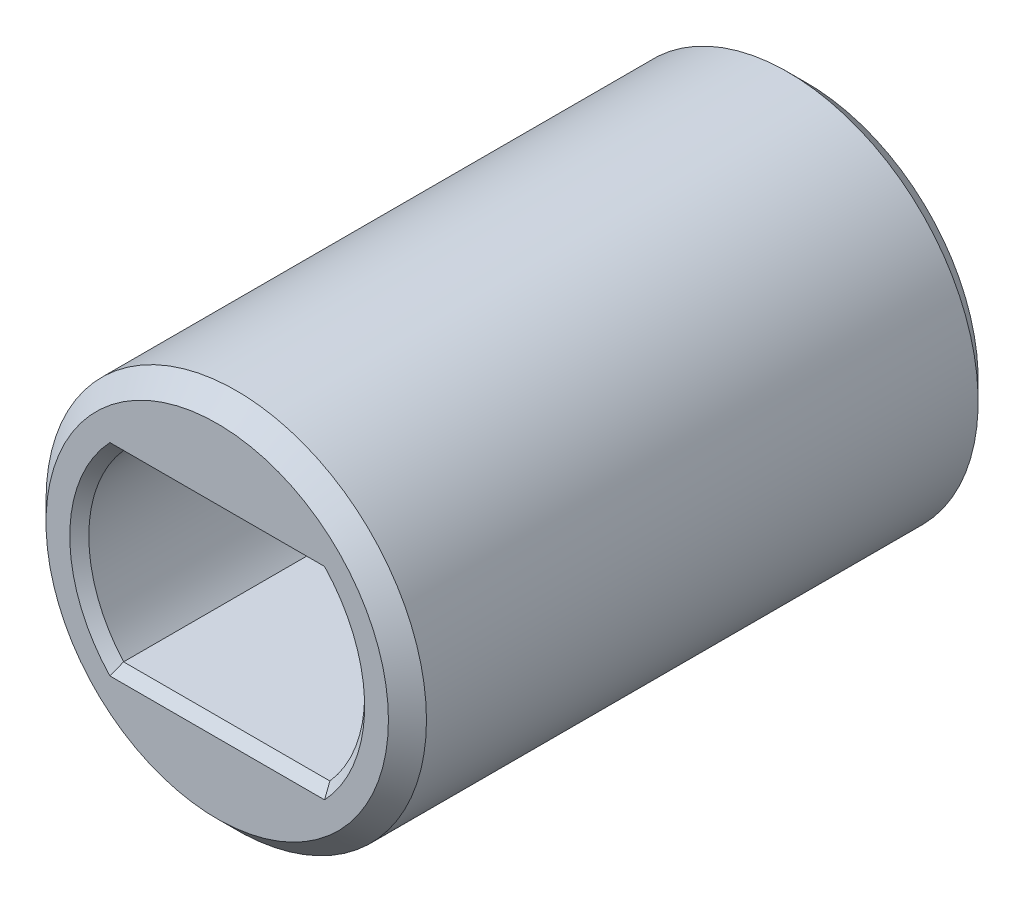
ISO-10303-21;
HEADER;
FILE_DESCRIPTION(('STEP AP214'),'2;1');
FILE_NAME('part.step','',(''),(''),'','','');
FILE_SCHEMA(('AUTOMOTIVE_DESIGN { 1 0 10303 214 1 1 1 1 }'));
ENDSEC;
DATA;
#1=APPLICATION_CONTEXT('core data for automotive mechanical design processes');
#2=APPLICATION_PROTOCOL_DEFINITION('international standard','automotive_design',2000,#1);
#3=PRODUCT_CONTEXT('',#1,'mechanical');
#4=PRODUCT('Part','Part','',(#3));
#5=PRODUCT_RELATED_PRODUCT_CATEGORY('part','',(#4));
#6=PRODUCT_DEFINITION_FORMATION('','',#4);
#7=PRODUCT_DEFINITION_CONTEXT('part definition',#1,'design');
#8=PRODUCT_DEFINITION('design','',#6,#7);
#9=PRODUCT_DEFINITION_SHAPE('','',#8);
#10=(LENGTH_UNIT() NAMED_UNIT(*) SI_UNIT(.MILLI.,.METRE.));
#11=(NAMED_UNIT(*) PLANE_ANGLE_UNIT() SI_UNIT($,.RADIAN.));
#12=(NAMED_UNIT(*) SI_UNIT($,.STERADIAN.) SOLID_ANGLE_UNIT());
#13=UNCERTAINTY_MEASURE_WITH_UNIT(LENGTH_MEASURE(1.E-05),#10,'distance_accuracy_value','');
#14=(GEOMETRIC_REPRESENTATION_CONTEXT(3) GLOBAL_UNCERTAINTY_ASSIGNED_CONTEXT((#13)) GLOBAL_UNIT_ASSIGNED_CONTEXT((#10,
#11,#12)) REPRESENTATION_CONTEXT('',''));
#15=CARTESIAN_POINT('',(0.,0.,0.));
#16=DIRECTION('',(0.,0.,1.));
#17=DIRECTION('',(1.,0.,0.));
#18=AXIS2_PLACEMENT_3D('',#15,#16,#17);
#19=CARTESIAN_POINT('',(0.,0.,8.4));
#20=DIRECTION('',(0.,0.,1.));
#21=DIRECTION('',(1.,0.,0.));
#22=AXIS2_PLACEMENT_3D('',#19,#20,#21);
#23=PLANE('',#22);
#24=CARTESIAN_POINT('',(0.,0.,8.4));
#25=DIRECTION('',(0.,0.,1.));
#26=DIRECTION('',(1.,0.,0.));
#27=AXIS2_PLACEMENT_3D('',#24,#25,#26);
#28=CIRCLE('',#27,3.6);
#29=CARTESIAN_POINT('',(3.6,0.,8.4));
#30=VERTEX_POINT('',#29);
#31=EDGE_CURVE('E11',#30,#30,#28,.T.);
#32=ORIENTED_EDGE('',*,*,#31,.T.);
#33=EDGE_LOOP('',(#32));
#34=FACE_BOUND('',#33,.T.);
#35=DIRECTION('',(1.,0.,0.));
#36=VECTOR('',#35,1.);
#37=CARTESIAN_POINT('',(0.,2.125,8.4));
#38=LINE('',#37,#36);
#39=CARTESIAN_POINT('',(-2.25707221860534,2.125,8.4));
#40=VERTEX_POINT('',#39);
#41=CARTESIAN_POINT('',(2.25707221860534,2.125,8.4));
#42=VERTEX_POINT('',#41);
#43=EDGE_CURVE('E118',#40,#42,#38,.T.);
#44=ORIENTED_EDGE('',*,*,#43,.T.);
#45=CARTESIAN_POINT('',(0.,0.,8.4));
#46=DIRECTION('',(0.,0.,1.));
#47=DIRECTION('',(1.,0.,0.));
#48=AXIS2_PLACEMENT_3D('',#45,#46,#47);
#49=CIRCLE('',#48,3.1);
#50=CARTESIAN_POINT('',(2.25707221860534,-2.125,8.4));
#51=VERTEX_POINT('',#50);
#52=EDGE_CURVE('E122',#42,#51,#49,.F.);
#53=ORIENTED_EDGE('',*,*,#52,.T.);
#54=DIRECTION('',(-1.,0.,0.));
#55=VECTOR('',#54,1.);
#56=CARTESIAN_POINT('',(0.,-2.125,8.4));
#57=LINE('',#56,#55);
#58=CARTESIAN_POINT('',(-2.25707221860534,-2.125,8.4));
#59=VERTEX_POINT('',#58);
#60=EDGE_CURVE('E120',#51,#59,#57,.T.);
#61=ORIENTED_EDGE('',*,*,#60,.T.);
#62=CARTESIAN_POINT('',(0.,0.,8.4));
#63=DIRECTION('',(0.,0.,1.));
#64=DIRECTION('',(1.,0.,0.));
#65=AXIS2_PLACEMENT_3D('',#62,#63,#64);
#66=CIRCLE('',#65,3.1);
#67=EDGE_CURVE('E116',#59,#40,#66,.F.);
#68=ORIENTED_EDGE('',*,*,#67,.T.);
#69=EDGE_LOOP('',(#44,#53,#61,#68));
#70=FACE_BOUND('',#69,.T.);
#71=ADVANCED_FACE('F32',(#34,#70),#23,.T.);
#72=CARTESIAN_POINT('',(0.,0.,8.4));
#73=DIRECTION('',(0.,0.,-1.));
#74=DIRECTION('',(-1.,0.,0.));
#75=AXIS2_PLACEMENT_3D('',#72,#73,#74);
#76=CYLINDRICAL_SURFACE('',#75,4.);
#77=CARTESIAN_POINT('',(0.,0.,-3.6));
#78=DIRECTION('',(0.,0.,-1.));
#79=DIRECTION('',(-1.,0.,0.));
#80=AXIS2_PLACEMENT_3D('',#77,#78,#79);
#81=CIRCLE('',#80,4.);
#82=CARTESIAN_POINT('',(-4.,0.,-3.6));
#83=VERTEX_POINT('',#82);
#84=EDGE_CURVE('E40',#83,#83,#81,.F.);
#85=ORIENTED_EDGE('',*,*,#84,.T.);
#86=EDGE_LOOP('',(#85));
#87=FACE_BOUND('',#86,.T.);
#88=CARTESIAN_POINT('',(0.,0.,8.00000000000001));
#89=DIRECTION('',(0.,0.,1.));
#90=DIRECTION('',(1.,0.,0.));
#91=AXIS2_PLACEMENT_3D('',#88,#89,#90);
#92=CIRCLE('',#91,4.);
#93=CARTESIAN_POINT('',(4.,0.,8.00000000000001));
#94=VERTEX_POINT('',#93);
#95=EDGE_CURVE('E351',#94,#94,#92,.F.);
#96=ORIENTED_EDGE('',*,*,#95,.T.);
#97=EDGE_LOOP('',(#96));
#98=FACE_BOUND('',#97,.T.);
#99=ADVANCED_FACE('F191',(#87,#98),#76,.T.);
#100=CARTESIAN_POINT('',(0.,0.,8.4));
#101=DIRECTION('',(0.,0.,-1.));
#102=DIRECTION('',(-1.,0.,0.));
#103=AXIS2_PLACEMENT_3D('',#100,#101,#102);
#104=CYLINDRICAL_SURFACE('',#103,2.9);
#105=DIRECTION('',(0.,0.,-1.));
#106=VECTOR('',#105,1.);
#107=CARTESIAN_POINT('',(-2.1689571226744,1.925,8.4));
#108=LINE('',#107,#106);
#109=CARTESIAN_POINT('',(-2.1689571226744,1.925,8.2));
#110=VERTEX_POINT('',#109);
#111=CARTESIAN_POINT('',(-2.1689571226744,1.925,0.));
#112=VERTEX_POINT('',#111);
#113=EDGE_CURVE('E84',#110,#112,#108,.T.);
#114=ORIENTED_EDGE('',*,*,#113,.F.);
#115=CARTESIAN_POINT('',(0.,0.,8.2));
#116=DIRECTION('',(0.,0.,1.));
#117=DIRECTION('',(1.,0.,0.));
#118=AXIS2_PLACEMENT_3D('',#115,#116,#117);
#119=CIRCLE('',#118,2.9);
#120=CARTESIAN_POINT('',(-2.1689571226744,-1.925,8.2));
#121=VERTEX_POINT('',#120);
#122=EDGE_CURVE('E54',#110,#121,#119,.T.);
#123=ORIENTED_EDGE('',*,*,#122,.T.);
#124=DIRECTION('',(0.,0.,-1.));
#125=VECTOR('',#124,1.);
#126=CARTESIAN_POINT('',(-2.1689571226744,-1.925,8.4));
#127=LINE('',#126,#125);
#128=CARTESIAN_POINT('',(-2.1689571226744,-1.925,0.));
#129=VERTEX_POINT('',#128);
#130=EDGE_CURVE('E95',#121,#129,#127,.T.);
#131=ORIENTED_EDGE('',*,*,#130,.T.);
#132=CARTESIAN_POINT('',(0.,0.,0.));
#133=DIRECTION('',(0.,0.,1.));
#134=DIRECTION('',(1.,0.,0.));
#135=AXIS2_PLACEMENT_3D('',#132,#133,#134);
#136=CIRCLE('',#135,2.9);
#137=EDGE_CURVE('E93',#112,#129,#136,.T.);
#138=ORIENTED_EDGE('',*,*,#137,.F.);
#139=EDGE_LOOP('',(#114,#123,#131,#138));
#140=FACE_BOUND('',#139,.T.);
#141=ADVANCED_FACE('F94',(#140),#104,.F.);
#142=CARTESIAN_POINT('',(-2.1689571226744,-1.925,8.4));
#143=DIRECTION('',(0.,1.,0.));
#144=DIRECTION('',(-1.,0.,0.));
#145=AXIS2_PLACEMENT_3D('',#142,#143,#144);
#146=PLANE('',#145);
#147=ORIENTED_EDGE('',*,*,#130,.F.);
#148=DIRECTION('',(1.,0.,0.));
#149=VECTOR('',#148,1.);
#150=CARTESIAN_POINT('',(-2.1689571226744,-1.925,8.2));
#151=LINE('',#150,#149);
#152=CARTESIAN_POINT('',(2.1689571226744,-1.925,8.2));
#153=VERTEX_POINT('',#152);
#154=EDGE_CURVE('E125',#121,#153,#151,.T.);
#155=ORIENTED_EDGE('',*,*,#154,.T.);
#156=DIRECTION('',(0.,0.,-1.));
#157=VECTOR('',#156,1.);
#158=CARTESIAN_POINT('',(2.1689571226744,-1.925,8.4));
#159=LINE('',#158,#157);
#160=CARTESIAN_POINT('',(2.1689571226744,-1.925,0.));
#161=VERTEX_POINT('',#160);
#162=EDGE_CURVE('E110',#153,#161,#159,.T.);
#163=ORIENTED_EDGE('',*,*,#162,.T.);
#164=DIRECTION('',(1.,0.,0.));
#165=VECTOR('',#164,1.);
#166=CARTESIAN_POINT('',(-2.1689571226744,-1.925,0.));
#167=LINE('',#166,#165);
#168=EDGE_CURVE('E99',#129,#161,#167,.T.);
#169=ORIENTED_EDGE('',*,*,#168,.F.);
#170=EDGE_LOOP('',(#147,#155,#163,#169));
#171=FACE_BOUND('',#170,.T.);
#172=ADVANCED_FACE('F202',(#171),#146,.T.);
#173=CARTESIAN_POINT('',(0.,0.,8.4));
#174=DIRECTION('',(0.,0.,-1.));
#175=DIRECTION('',(-1.,0.,0.));
#176=AXIS2_PLACEMENT_3D('',#173,#174,#175);
#177=CYLINDRICAL_SURFACE('',#176,2.9);
#178=ORIENTED_EDGE('',*,*,#162,.F.);
#179=CARTESIAN_POINT('',(0.,0.,8.2));
#180=DIRECTION('',(0.,0.,1.));
#181=DIRECTION('',(1.,0.,0.));
#182=AXIS2_PLACEMENT_3D('',#179,#180,#181);
#183=CIRCLE('',#182,2.9);
#184=CARTESIAN_POINT('',(2.1689571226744,1.925,8.2));
#185=VERTEX_POINT('',#184);
#186=EDGE_CURVE('E113',#153,#185,#183,.T.);
#187=ORIENTED_EDGE('',*,*,#186,.T.);
#188=DIRECTION('',(0.,0.,-1.));
#189=VECTOR('',#188,1.);
#190=CARTESIAN_POINT('',(2.1689571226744,1.925,8.4));
#191=LINE('',#190,#189);
#192=CARTESIAN_POINT('',(2.1689571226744,1.925,0.));
#193=VERTEX_POINT('',#192);
#194=EDGE_CURVE('E90',#185,#193,#191,.T.);
#195=ORIENTED_EDGE('',*,*,#194,.T.);
#196=CARTESIAN_POINT('',(0.,0.,0.));
#197=DIRECTION('',(0.,0.,1.));
#198=DIRECTION('',(1.,0.,0.));
#199=AXIS2_PLACEMENT_3D('',#196,#197,#198);
#200=CIRCLE('',#199,2.9);
#201=EDGE_CURVE('E104',#161,#193,#200,.T.);
#202=ORIENTED_EDGE('',*,*,#201,.F.);
#203=EDGE_LOOP('',(#178,#187,#195,#202));
#204=FACE_BOUND('',#203,.T.);
#205=ADVANCED_FACE('F205',(#204),#177,.F.);
#206=CARTESIAN_POINT('',(-2.1689571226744,1.925,8.4));
#207=DIRECTION('',(0.,-1.,0.));
#208=DIRECTION('',(1.,0.,0.));
#209=AXIS2_PLACEMENT_3D('',#206,#207,#208);
#210=PLANE('',#209);
#211=ORIENTED_EDGE('',*,*,#194,.F.);
#212=DIRECTION('',(-1.,0.,0.));
#213=VECTOR('',#212,1.);
#214=CARTESIAN_POINT('',(-2.1689571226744,1.925,8.2));
#215=LINE('',#214,#213);
#216=EDGE_CURVE('E47',#185,#110,#215,.T.);
#217=ORIENTED_EDGE('',*,*,#216,.T.);
#218=ORIENTED_EDGE('',*,*,#113,.T.);
#219=DIRECTION('',(-1.,0.,0.));
#220=VECTOR('',#219,1.);
#221=CARTESIAN_POINT('',(-2.1689571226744,1.925,0.));
#222=LINE('',#221,#220);
#223=EDGE_CURVE('E88',#193,#112,#222,.T.);
#224=ORIENTED_EDGE('',*,*,#223,.F.);
#225=EDGE_LOOP('',(#211,#217,#218,#224));
#226=FACE_BOUND('',#225,.T.);
#227=ADVANCED_FACE('F86',(#226),#210,.T.);
#228=CARTESIAN_POINT('',(0.,0.,0.));
#229=DIRECTION('',(0.,0.,-1.));
#230=DIRECTION('',(-1.,0.,0.));
#231=AXIS2_PLACEMENT_3D('',#228,#229,#230);
#232=PLANE('',#231);
#233=ORIENTED_EDGE('',*,*,#137,.T.);
#234=ORIENTED_EDGE('',*,*,#168,.T.);
#235=ORIENTED_EDGE('',*,*,#201,.T.);
#236=ORIENTED_EDGE('',*,*,#223,.T.);
#237=EDGE_LOOP('',(#233,#234,#235,#236));
#238=FACE_BOUND('',#237,.T.);
#239=ADVANCED_FACE('F102',(#238),#232,.F.);
#240=CARTESIAN_POINT('',(0.,0.,-4.));
#241=DIRECTION('',(0.,0.,-1.));
#242=DIRECTION('',(-1.,0.,0.));
#243=AXIS2_PLACEMENT_3D('',#240,#241,#242);
#244=PLANE('',#243);
#245=CARTESIAN_POINT('',(0.,0.,-4.));
#246=DIRECTION('',(0.,0.,-1.));
#247=DIRECTION('',(-1.,0.,0.));
#248=AXIS2_PLACEMENT_3D('',#245,#246,#247);
#249=CIRCLE('',#248,3.6);
#250=CARTESIAN_POINT('',(-3.6,0.,-4.));
#251=VERTEX_POINT('',#250);
#252=EDGE_CURVE('E135',#251,#251,#249,.T.);
#253=ORIENTED_EDGE('',*,*,#252,.T.);
#254=EDGE_LOOP('',(#253));
#255=FACE_BOUND('',#254,.T.);
#256=CARTESIAN_POINT('',(0.,0.,-4.));
#257=DIRECTION('',(0.,0.,-1.));
#258=DIRECTION('',(-1.,0.,0.));
#259=AXIS2_PLACEMENT_3D('',#256,#257,#258);
#260=CIRCLE('',#259,2.2);
#261=CARTESIAN_POINT('',(-2.2,0.,-4.));
#262=VERTEX_POINT('',#261);
#263=EDGE_CURVE('E132',#262,#262,#260,.F.);
#264=ORIENTED_EDGE('',*,*,#263,.T.);
#265=EDGE_LOOP('',(#264));
#266=FACE_BOUND('',#265,.T.);
#267=ADVANCED_FACE('F214',(#255,#266),#244,.T.);
#268=CARTESIAN_POINT('',(0.,0.,-2.));
#269=DIRECTION('',(0.,0.,-1.));
#270=DIRECTION('',(-1.,0.,0.));
#271=AXIS2_PLACEMENT_3D('',#268,#269,#270);
#272=CYLINDRICAL_SURFACE('',#271,2.);
#273=CARTESIAN_POINT('',(0.,0.,-3.8));
#274=DIRECTION('',(0.,0.,-1.));
#275=DIRECTION('',(-1.,0.,0.));
#276=AXIS2_PLACEMENT_3D('',#273,#274,#275);
#277=CIRCLE('',#276,2.);
#278=CARTESIAN_POINT('',(-2.,0.,-3.8));
#279=VERTEX_POINT('',#278);
#280=EDGE_CURVE('E129',#279,#279,#277,.T.);
#281=ORIENTED_EDGE('',*,*,#280,.T.);
#282=EDGE_LOOP('',(#281));
#283=FACE_BOUND('',#282,.T.);
#284=CARTESIAN_POINT('',(0.,0.,-2.));
#285=DIRECTION('',(0.,0.,-1.));
#286=DIRECTION('',(-1.,0.,0.));
#287=AXIS2_PLACEMENT_3D('',#284,#285,#286);
#288=CIRCLE('',#287,2.);
#289=CARTESIAN_POINT('',(-2.,0.,-2.));
#290=VERTEX_POINT('',#289);
#291=EDGE_CURVE('E100',#290,#290,#288,.T.);
#292=ORIENTED_EDGE('',*,*,#291,.F.);
#293=EDGE_LOOP('',(#292));
#294=FACE_BOUND('',#293,.T.);
#295=ADVANCED_FACE('F217',(#283,#294),#272,.F.);
#296=CARTESIAN_POINT('',(0.,0.,-2.));
#297=DIRECTION('',(0.,0.,-1.));
#298=DIRECTION('',(-1.,0.,0.));
#299=AXIS2_PLACEMENT_3D('',#296,#297,#298);
#300=PLANE('',#299);
#301=ORIENTED_EDGE('',*,*,#291,.T.);
#302=EDGE_LOOP('',(#301));
#303=FACE_BOUND('',#302,.T.);
#304=ADVANCED_FACE('F175',(#303),#300,.T.);
#305=CARTESIAN_POINT('',(0.,0.,8.2));
#306=DIRECTION('',(0.,0.,1.));
#307=DIRECTION('',(1.,0.,0.));
#308=AXIS2_PLACEMENT_3D('',#305,#306,#307);
#309=CONICAL_SURFACE('',#308,2.9,0.78539816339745);
#310=CARTESIAN_POINT('',(-2.1689571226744,1.925,8.2));
#311=CARTESIAN_POINT('',(-2.18390946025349,1.95827463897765,8.23327463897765));
#312=CARTESIAN_POINT('',(-2.19872855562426,1.99157862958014,8.26657862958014));
#313=CARTESIAN_POINT('',(-2.22810025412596,2.05824529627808,8.33324529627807));
#314=CARTESIAN_POINT('',(-2.24265285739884,2.09160797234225,8.36660797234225));
#315=CARTESIAN_POINT('',(-2.25707221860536,2.125,8.4));
#316=B_SPLINE_CURVE_WITH_KNOTS('',3,(#310,#311,#312,#313,#314,#315),.UNSPECIFIED.,.F.,.F.,(4,2,
4),(0.,0.1481258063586,0.296251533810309),.UNSPECIFIED.);
#317=EDGE_CURVE('E160',#40,#110,#316,.F.);
#318=ORIENTED_EDGE('',*,*,#317,.F.);
#319=ORIENTED_EDGE('',*,*,#67,.F.);
#320=CARTESIAN_POINT('',(-2.25707221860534,-2.125,8.4));
#321=CARTESIAN_POINT('',(-2.24265285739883,-2.09160797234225,8.36660797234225));
#322=CARTESIAN_POINT('',(-2.22810025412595,-2.05824529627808,8.33324529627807));
#323=CARTESIAN_POINT('',(-2.19872855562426,-1.99157862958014,8.26657862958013));
#324=CARTESIAN_POINT('',(-2.1839094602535,-1.95827463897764,8.23327463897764));
#325=CARTESIAN_POINT('',(-2.16895712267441,-1.925,8.2));
#326=B_SPLINE_CURVE_WITH_KNOTS('',3,(#320,#321,#322,#323,#324,#325),.UNSPECIFIED.,.F.,.F.,(4,2,
4),(0.,0.14812572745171,0.296251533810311),.UNSPECIFIED.);
#327=EDGE_CURVE('E166',#121,#59,#326,.F.);
#328=ORIENTED_EDGE('',*,*,#327,.F.);
#329=ORIENTED_EDGE('',*,*,#122,.F.);
#330=EDGE_LOOP('',(#318,#319,#328,#329));
#331=FACE_BOUND('',#330,.T.);
#332=ADVANCED_FACE('F171',(#331),#309,.F.);
#333=CARTESIAN_POINT('',(-2.1689571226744,-1.925,8.2));
#334=DIRECTION('',(0.,-0.707106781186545,-0.70710678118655));
#335=DIRECTION('',(1.,0.,0.));
#336=AXIS2_PLACEMENT_3D('',#333,#334,#335);
#337=PLANE('',#336);
#338=ORIENTED_EDGE('',*,*,#327,.T.);
#339=ORIENTED_EDGE('',*,*,#60,.F.);
#340=CARTESIAN_POINT('',(2.25707221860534,-2.125,8.4));
#341=CARTESIAN_POINT('',(2.24265285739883,-2.09160797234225,8.36660797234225));
#342=CARTESIAN_POINT('',(2.22810025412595,-2.05824529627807,8.33324529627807));
#343=CARTESIAN_POINT('',(2.19872855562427,-1.99157862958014,8.26657862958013));
#344=CARTESIAN_POINT('',(2.18390946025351,-1.95827463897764,8.23327463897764));
#345=CARTESIAN_POINT('',(2.16895712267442,-1.925,8.2));
#346=B_SPLINE_CURVE_WITH_KNOTS('',3,(#340,#341,#342,#343,#344,#345),.UNSPECIFIED.,.F.,.F.,(4,2,
4),(0.,0.148125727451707,0.296251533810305),.UNSPECIFIED.);
#347=EDGE_CURVE('E143',#153,#51,#346,.F.);
#348=ORIENTED_EDGE('',*,*,#347,.F.);
#349=ORIENTED_EDGE('',*,*,#154,.F.);
#350=EDGE_LOOP('',(#338,#339,#348,#349));
#351=FACE_BOUND('',#350,.T.);
#352=ADVANCED_FACE('F155',(#351),#337,.F.);
#353=CARTESIAN_POINT('',(-2.1689571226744,1.925,8.2));
#354=DIRECTION('',(0.,0.707106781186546,-0.707106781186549));
#355=DIRECTION('',(-1.,0.,0.));
#356=AXIS2_PLACEMENT_3D('',#353,#354,#355);
#357=PLANE('',#356);
#358=ORIENTED_EDGE('',*,*,#317,.T.);
#359=ORIENTED_EDGE('',*,*,#216,.F.);
#360=CARTESIAN_POINT('',(2.1689571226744,1.925,8.2));
#361=CARTESIAN_POINT('',(2.18390946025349,1.95827463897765,8.23327463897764));
#362=CARTESIAN_POINT('',(2.19872855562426,1.99157862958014,8.26657862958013));
#363=CARTESIAN_POINT('',(2.22810025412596,2.05824529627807,8.33324529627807));
#364=CARTESIAN_POINT('',(2.24265285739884,2.09160797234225,8.36660797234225));
#365=CARTESIAN_POINT('',(2.25707221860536,2.125,8.4));
#366=B_SPLINE_CURVE_WITH_KNOTS('',3,(#360,#361,#362,#363,#364,#365),.UNSPECIFIED.,.F.,.F.,(4,2,
4),(0.,0.148125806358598,0.296251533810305),.UNSPECIFIED.);
#367=EDGE_CURVE('E136',#42,#185,#366,.F.);
#368=ORIENTED_EDGE('',*,*,#367,.F.);
#369=ORIENTED_EDGE('',*,*,#43,.F.);
#370=EDGE_LOOP('',(#358,#359,#368,#369));
#371=FACE_BOUND('',#370,.T.);
#372=ADVANCED_FACE('F152',(#371),#357,.F.);
#373=CARTESIAN_POINT('',(0.,0.,8.2));
#374=DIRECTION('',(0.,0.,1.));
#375=DIRECTION('',(1.,0.,0.));
#376=AXIS2_PLACEMENT_3D('',#373,#374,#375);
#377=CONICAL_SURFACE('',#376,2.9,0.78539816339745);
#378=ORIENTED_EDGE('',*,*,#347,.T.);
#379=ORIENTED_EDGE('',*,*,#52,.F.);
#380=ORIENTED_EDGE('',*,*,#367,.T.);
#381=ORIENTED_EDGE('',*,*,#186,.F.);
#382=EDGE_LOOP('',(#378,#379,#380,#381));
#383=FACE_BOUND('',#382,.T.);
#384=ADVANCED_FACE('F149',(#383),#377,.F.);
#385=CARTESIAN_POINT('',(0.,0.,-3.8));
#386=DIRECTION('',(0.,0.,-1.));
#387=DIRECTION('',(-1.,0.,0.));
#388=AXIS2_PLACEMENT_3D('',#385,#386,#387);
#389=CONICAL_SURFACE('',#388,2.,0.785398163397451);
#390=ORIENTED_EDGE('',*,*,#263,.F.);
#391=EDGE_LOOP('',(#390));
#392=FACE_BOUND('',#391,.T.);
#393=ORIENTED_EDGE('',*,*,#280,.F.);
#394=EDGE_LOOP('',(#393));
#395=FACE_BOUND('',#394,.T.);
#396=ADVANCED_FACE('F177',(#392,#395),#389,.F.);
#397=CARTESIAN_POINT('',(0.,0.,-4.));
#398=DIRECTION('',(0.,0.,1.));
#399=DIRECTION('',(1.,0.,0.));
#400=AXIS2_PLACEMENT_3D('',#397,#398,#399);
#401=CONICAL_SURFACE('',#400,3.6,0.785398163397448);
#402=ORIENTED_EDGE('',*,*,#84,.F.);
#403=EDGE_LOOP('',(#402));
#404=FACE_BOUND('',#403,.T.);
#405=ORIENTED_EDGE('',*,*,#252,.F.);
#406=EDGE_LOOP('',(#405));
#407=FACE_BOUND('',#406,.T.);
#408=ADVANCED_FACE('F180',(#404,#407),#401,.T.);
#409=CARTESIAN_POINT('',(0.,0.,8.4));
#410=DIRECTION('',(0.,0.,-1.));
#411=DIRECTION('',(-1.,0.,0.));
#412=AXIS2_PLACEMENT_3D('',#409,#410,#411);
#413=CONICAL_SURFACE('',#412,3.6,0.78539816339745);
#414=ORIENTED_EDGE('',*,*,#95,.F.);
#415=EDGE_LOOP('',(#414));
#416=FACE_BOUND('',#415,.T.);
#417=ORIENTED_EDGE('',*,*,#31,.F.);
#418=EDGE_LOOP('',(#417));
#419=FACE_BOUND('',#418,.T.);
#420=ADVANCED_FACE('F34',(#416,#419),#413,.T.);
#421=CLOSED_SHELL('',(#71,#99,#141,#172,#205,#227,#239,#267,#295,#304,#332,#352,#372,#384,#396,
#408,#420));
#422=MANIFOLD_SOLID_BREP('B2',#421);
#423=ADVANCED_BREP_SHAPE_REPRESENTATION('',(#18,#422),#14);
#424=SHAPE_DEFINITION_REPRESENTATION(#9,#423);
ENDSEC;
END-ISO-10303-21;
